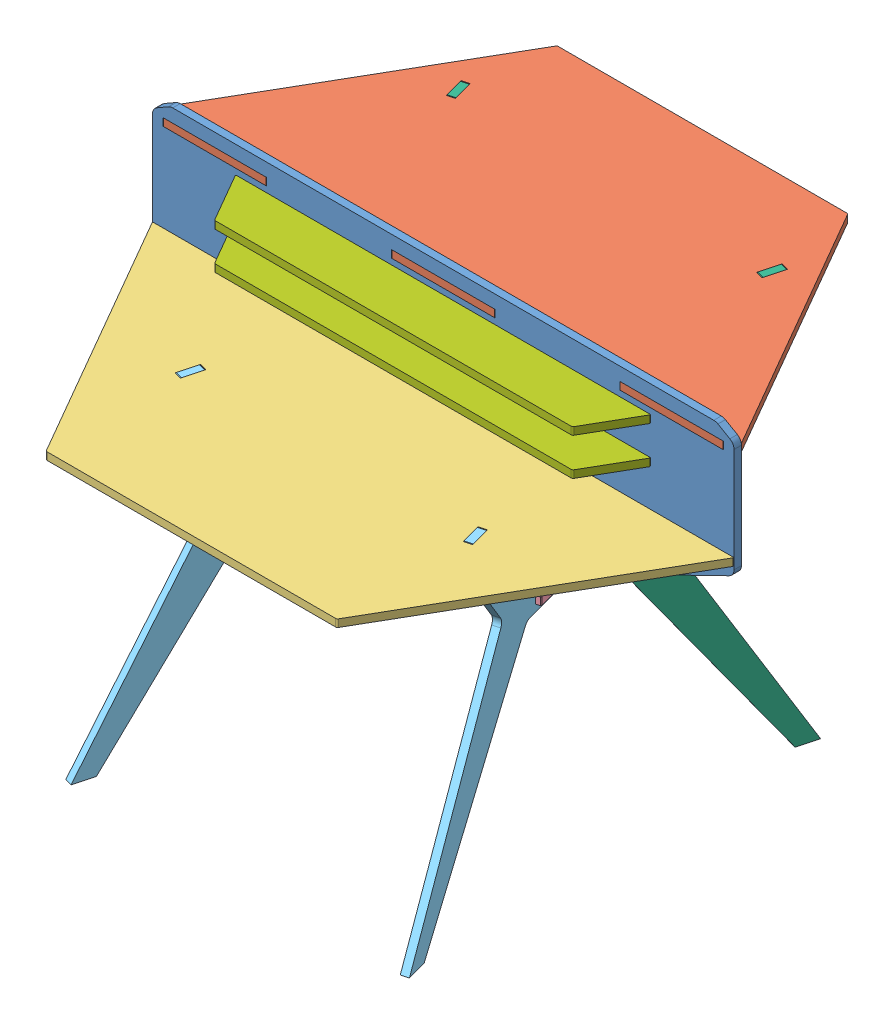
SolidWorks assembly Mesa hexagonal.SLDASM, configuration Predeterminado (file format 11000). Lengths in mm.
Overall size (1400 1034 1230.44).
10 component instances, 7 part files, 27 mates.
Components (placement in the parent):
- Pieza central-1: Pieza central.SLDPRT [Predeterminado] at (-406.2718 -549.6746 1394) size (1400 518 18)
- Mesa alta-1: Mesa alta.SLDPRT [Predeterminado] at (293.7282 -99.6746 1394) size (1398.27 18 624.22)
- Mesa baja-1: Mesa baja.SLDPRT [Predeterminado] at (293.7282 -329.6746 1412) size (1398.27 18 624.22)
- Union central-1: Union central.SLDPRT [Predeterminado] at (3.7282 -567.6746 1433) size (625.02 18 187.42)
- Pata baja-3: Pata baja.SLDPRT [Predeterminado] at (-102.5813 -1083.6746 1911.7998) x (-0.258819 0 0.965926) z (-0.965926 0 -0.258819) size (520 772 18)
- Pata baja-4: Pata baja.SLDPRT [Predeterminado] at (707.4244 -1083.6746 1907.141) x (0.258819 0 0.965926) z (-0.965926 0 0.258819) size (520 772 18)
- Pata alta-3: Pata alta.SLDPRT [Predeterminado] at (-116.0856 -1083.6746 913.3478) x (-0.258819 0 -0.965926) z (0.965926 0 -0.258819) size (505 1002 18)
- Pata alta-4: Pata alta.SLDPRT [Predeterminado] at (686.1554 -1083.6746 908.6891) x (0.258819 0 -0.965926) z (0.965926 0 0.258819) size (505 1002 18)
- Baldas-1: Baldas.SLDPRT [Predeterminado] at (293.7282 -221.6746 1412) size (998.27 18 138)
- Baldas-2: Baldas.SLDPRT [Predeterminado] at (293.7282 -131.6746 1412) size (998.27 18 138)
Mates (geometry in assembly coordinates):
- Coincidente1: coincident: plane of Pieza central-1 through (-406.2718 -549.6746 1394) normal (0 0 -1); plane of Mesa alta-1 through (-406.2718 -99.6746 1394) normal (0 0 1)
- Coincidente2: coincident: plane of Pieza central-1 through (-406.2718 -549.6746 1412) normal (0 0 1); plane of Mesa baja-1 through (-406.2718 -329.6746 1412) normal (0 0 -1)
- Coincidente3: coincident: plane of Pieza central-1 through (-381.2718 -311.6746 1394) normal (1 0 0); plane of Mesa baja-1 through (-381.2718 -329.6746 1412) normal (-1 0 0)
- Coincidente4: coincident: plane of Pieza central-1 through (-381.2718 -311.6746 1394) normal (0 -1 0); plane of Mesa baja-1 through (293.7282 -311.6746 1412) normal (0 1 0)
- Coincidente5: coincident: plane of Pieza central-1 through (-381.2718 -99.6746 1394) normal (1 0 0); plane of Mesa alta-1 through (-381.2718 -99.6746 1394) normal (-1 0 0)
- Coincidente6: coincident: plane of Pieza central-1 through (-131.2718 -81.6746 1394) normal (0 -1 0); plane of Mesa alta-1 through (293.7282 -81.6746 1394) normal (0 1 0)
- Coincidente7: coincident: plane of Pieza central-1 through (-406.2718 -549.6746 1412) normal (0 0 1); plane of Union central-1 through (393.7282 -567.6746 1412) normal (0 0 -1)
- Coincidente8: coincident: plane of Pieza central-1 through (-406.2718 -549.6746 1412) normal (0 -1 0); plane of Union central-1 through (3.7282 -549.6746 1433) normal (0 1 0)
- Coincidente9: coincident: plane of Pieza central-1 through (543.7282 -567.6746 1412) normal (1 0 0); plane of Union central-1 through (543.7282 -567.6746 1394) normal (-1 0 0)
- Coincidente13: coincident: plane of Union central-1 through (3.7282 -549.6746 1433) normal (0 1 0); plane of Pata baja-3 through (14.618 -549.6746 1404.8596) normal (0 -1 0)
- Coincidente14: coincident: plane of Union central-1 through (-0.1541 -549.6746 1447.4889) normal (-0.258819 0 0.965926); plane of Pata baja-3 through (2.9711 -549.6746 1448.3263) normal (0.258819 0 -0.965926)
- Coincidente15: coincident: plane of Union central-1 through (6.8534 -549.6746 1433.8374) normal (0.965926 0 0.258819); plane of Pata baja-3 through (-119.9679 -1083.6746 1907.141) normal (-0.965926 0 -0.258819)
- Coincidente16: coincident: plane of Union central-1 through (524.3637 -549.6746 1293.4961) normal (0.965926 0 -0.258819); plane of Pata baja-4 through (690.0377 -1083.6746 1911.7998) normal (-0.965926 0 0.258819)
- Coincidente17: coincident: plane of Union central-1 through (46.4631 -549.6746 1592.4889) normal (0.258819 0 0.965926); plane of Pata baja-4 through (567.0987 -549.6746 1452.985) normal (-0.258819 0 -0.965926)
- Coincidente18: coincident: plane of Union central-1 through (3.7282 -567.6746 1433) normal (0 -1 0); plane of Pata baja-4 through (567.0987 -567.6746 1452.985) normal (0 1 0)
- Coincidente19: coincident: plane of Union central-1 through (21.8534 -549.6746 1428.1434) normal (0.965926 0 -0.258819); plane of Pata alta-3 through (-116.0856 -1083.6746 913.3478) normal (-0.965926 0 0.258819)
- Coincidente20: coincident: plane of Union central-1 through (3.7282 -567.6746 1433) normal (0 -1 0); plane of Pata alta-3 through (20.3578 -567.6746 1353.015) normal (0 1 0)
- Coincidente21: coincident: plane of Union central-1 through (-15.1541 -549.6746 1362.5304) normal (-0.258819 0 -0.965926); plane of Pata alta-3 through (20.3578 -549.6746 1353.015) normal (0.258819 0 0.965926)
- Coincidente22: coincident: plane of Union central-1 through (526.7504 -549.6746 1573.1434) normal (-0.965926 0 -0.258819); plane of Pata alta-4 through (703.5421 -1083.6746 913.3478) normal (0.965926 0 0.258819)
- Coincidente23: coincident: plane of Union central-1 through (3.7282 -567.6746 1433) normal (0 -1 0); plane of Pata alta-4 through (584.4853 -567.6746 1357.6737) normal (0 1 0)
- Coincidente24: coincident: plane of Union central-1 through (61.4631 -549.6746 1217.5304) normal (0.258819 0 -0.965926); plane of Pata alta-4 through (584.4853 -549.6746 1357.6737) normal (-0.258819 0 0.965926)
- Coincidente25: coincident: plane of Pieza central-1 through (-406.2718 -549.6746 1412) normal (0 0 1); plane of Baldas-1 through (-206.2718 -221.6746 1412) normal (0 0 -1)
- Coincidente26: coincident: plane of Baldas-1 through (-206.2718 -221.6746 1412) normal (0 0 -1); plane of Baldas-2 through (-206.2718 -131.6746 1412) normal (0 0 -1)
- Coincidente27: coincident: plane of Pieza central-1 through (-106.2718 -113.6746 1394) normal (0 -1 0); plane of Baldas-2 through (293.7282 -113.6746 1412) normal (0 1 0)
- Coincidente28: coincident: plane of Pieza central-1 through (-106.2718 -203.6746 1394) normal (0 -1 0); plane of Baldas-1 through (293.7282 -203.6746 1412) normal (0 1 0)
- Coincidente29: coincident: plane of Pieza central-1 through (693.7282 -113.6746 1394) normal (-1 0 0); plane of Baldas-2 through (693.7282 -131.6746 1412) normal (1 0 0)
- Coincidente30: coincident: plane of Pieza central-1 through (693.7282 -203.6746 1394) normal (-1 0 0); plane of Baldas-1 through (693.7282 -221.6746 1412) normal (1 0 0)
